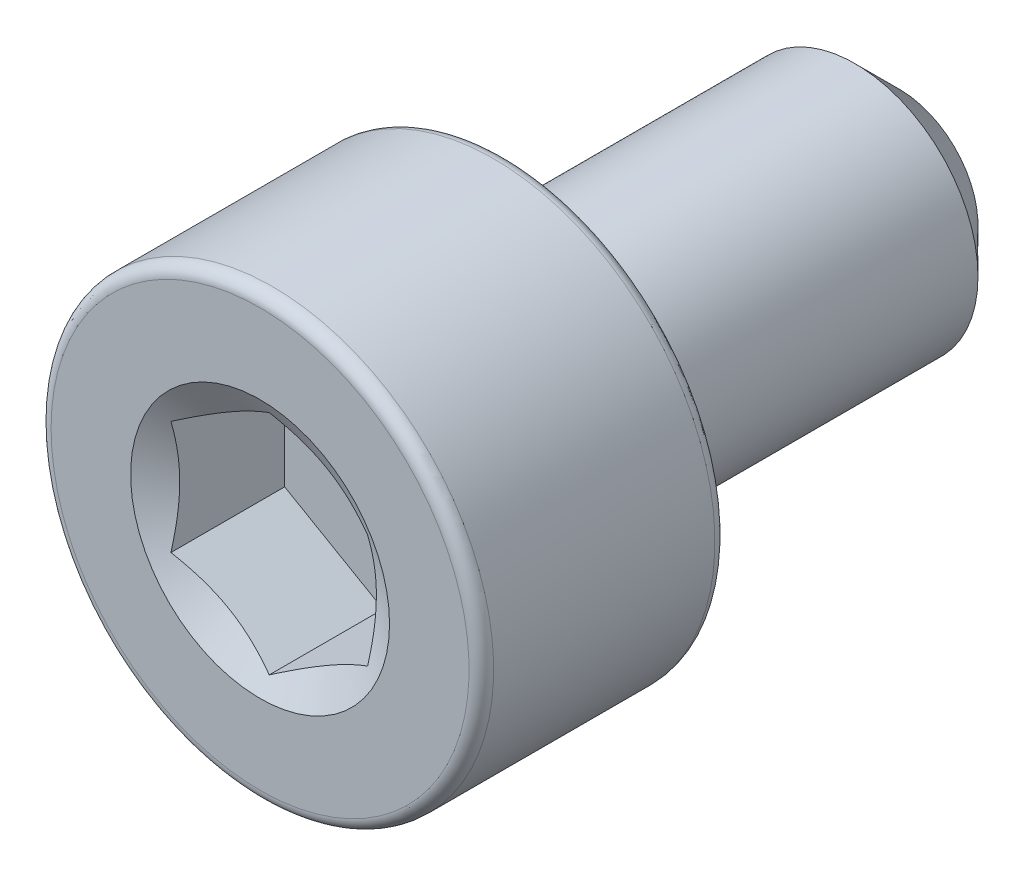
from build123d import *

# Parameters (mm, degrees)
CUT_EXTRUDE1_START = 3.25
CUT_EXTRUDE1_DEPTH = 1.25


with BuildPart() as part:
    # Sketch2 → Revolve1 (revolve)
    with BuildSketch(Plane(origin=(0, 0, 0), x_dir=(0, 0, -1), z_dir=(1, 0, 0)), mode=Mode.PRIVATE) as revolve1_sk:
        with BuildLine():
            Line((3.25, 0), (3.25, 0.8))
            Line((3.25, 0.8), (2.8, 1.25))
            Line((2.8, 1.25), (-0.75, 1.25))
            Line((-0.75, 1.25), (-0.75, 2.125))
            ThreePointArc((-0.75, 2.125), (-0.786611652, 2.213388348), (-0.875, 2.25))
            Line((-0.875, 2.25), (-3.125, 2.25))
            ThreePointArc((-3.125, 2.25), (-3.213388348, 2.213388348), (-3.25, 2.125))
            Line((-3.25, 2.125), (-3.25, 0))
            Line((-3.25, 0), (3.25, 0))
        make_face()
    revolve(revolve1_sk.sketch.rotate(Axis((0, 0, -3.25), (0, 0, 1)), 90), axis=Axis((0, 0, -3.25), (0, 0, 1)))

    # Sketch3 → Cut-Extrude1 (cut)
    with BuildSketch(Plane.XY.offset(CUT_EXTRUDE1_START)):
        Polygon((-1, 0.577350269), (-1, -0.577350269), (0, -1.154700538), (1, -0.577350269), (1, 0.577350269), (0, 1.154700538), align=None)
    extrude(amount=-CUT_EXTRUDE1_DEPTH, mode=Mode.SUBTRACT)

    # Cut-Extrude2 cone 1 section (on through the dimple's axis) → Cut-Extrude2 (revolve, cut)
    with BuildSketch(Plane(origin=(0, 0, 3.25), x_dir=(0, -1, 0), z_dir=(1, 0, 0))):
        Polygon((0, 0), (1.316417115, 0), (0, 0.760033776), align=None)
    revolve(axis=Axis((0, 0, 3.25), (0, 0, -1)), mode=Mode.SUBTRACT)


solid = part.part
